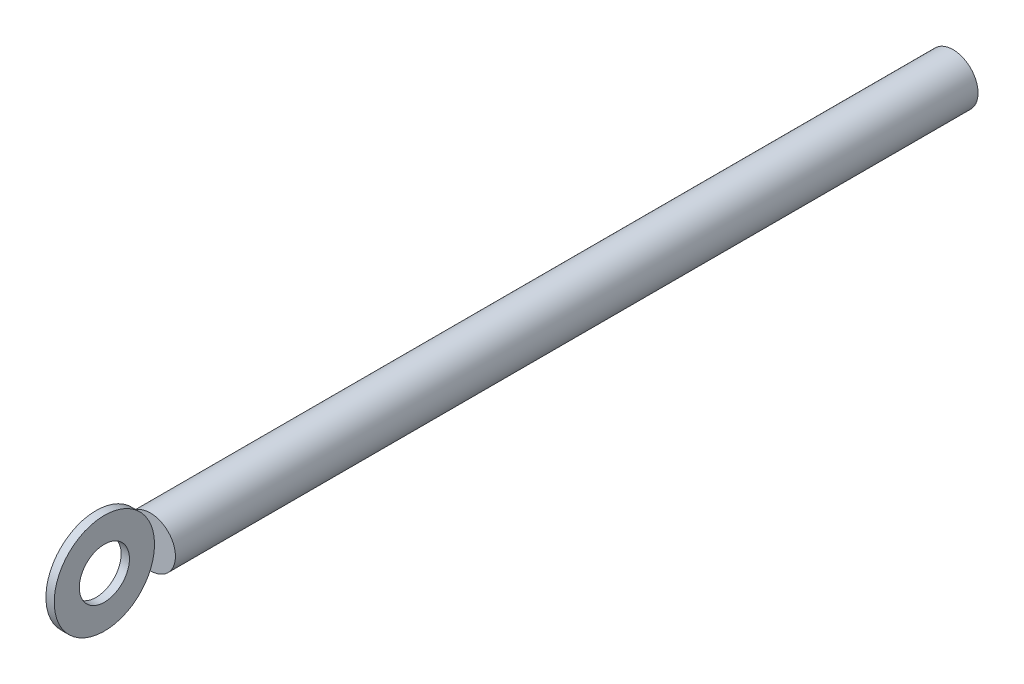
from build123d import *

# Parameters (mm, degrees)
SKETCH1_R          = 4.7625
EXTRUDE1_DEPTH     = 76.2
SKETCH2_R          = 9.525
EXTRUDE2_DEPTH     = 0.7874
SKETCH3_R          = 4.7625
CUT_EXTRUDE1_DEPTH = 96.885814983


with BuildPart() as part:
    # Sketch1 → Extrude1 (new, symmetric)
    with BuildSketch(Plane.XY):
        with Locations(Location((0, 0, 0), (0, 0, 180))):
            Circle(SKETCH1_R)
    extrude(amount=EXTRUDE1_DEPTH, both=True)


with BuildPart() as body_2:
    # Sketch2 → Extrude2 (new, symmetric)
    with BuildSketch(Plane(origin=(0, 0, 0), x_dir=(0, 0, -1), z_dir=(1, 0, 0))):
        with Locations((-85.725, 0)):
            Circle(SKETCH2_R)
    extrude(amount=EXTRUDE2_DEPTH, both=True)

    # Sketch3 → Cut-Extrude1 (cut, through all)
    with BuildSketch(Plane.ZY.offset(0.7874)):
        with Locations((85.725, 0)):
            Circle(SKETCH3_R)
    extrude(amount=-CUT_EXTRUDE1_DEPTH, mode=Mode.SUBTRACT)


solid = Compound([part.part, body_2.part])
